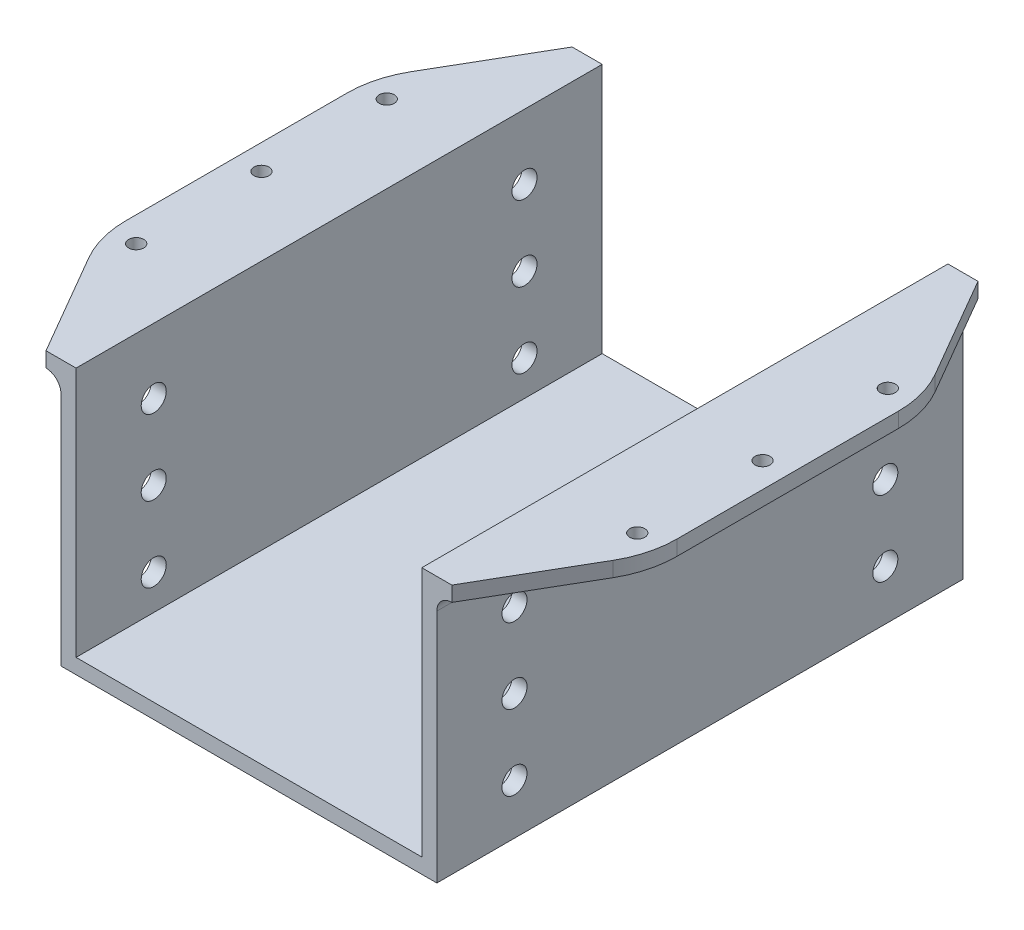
ISO-10303-21;
HEADER;
FILE_DESCRIPTION(('STEP AP214'),'2;1');
FILE_NAME('part.step','',(''),(''),'','','');
FILE_SCHEMA(('AUTOMOTIVE_DESIGN { 1 0 10303 214 1 1 1 1 }'));
ENDSEC;
DATA;
#1=APPLICATION_CONTEXT('core data for automotive mechanical design processes');
#2=APPLICATION_PROTOCOL_DEFINITION('international standard','automotive_design',2000,#1);
#3=PRODUCT_CONTEXT('',#1,'mechanical');
#4=PRODUCT('Part','Part','',(#3));
#5=PRODUCT_RELATED_PRODUCT_CATEGORY('part','',(#4));
#6=PRODUCT_DEFINITION_FORMATION('','',#4);
#7=PRODUCT_DEFINITION_CONTEXT('part definition',#1,'design');
#8=PRODUCT_DEFINITION('design','',#6,#7);
#9=PRODUCT_DEFINITION_SHAPE('','',#8);
#10=(LENGTH_UNIT() NAMED_UNIT(*) SI_UNIT(.MILLI.,.METRE.));
#11=(NAMED_UNIT(*) PLANE_ANGLE_UNIT() SI_UNIT($,.RADIAN.));
#12=(NAMED_UNIT(*) SI_UNIT($,.STERADIAN.) SOLID_ANGLE_UNIT());
#13=UNCERTAINTY_MEASURE_WITH_UNIT(LENGTH_MEASURE(1.E-05),#10,'distance_accuracy_value','');
#14=(GEOMETRIC_REPRESENTATION_CONTEXT(3) GLOBAL_UNCERTAINTY_ASSIGNED_CONTEXT((#13)) GLOBAL_UNIT_ASSIGNED_CONTEXT((#10,
#11,#12)) REPRESENTATION_CONTEXT('',''));
#15=CARTESIAN_POINT('',(0.,0.,0.));
#16=DIRECTION('',(0.,0.,1.));
#17=DIRECTION('',(1.,0.,0.));
#18=AXIS2_PLACEMENT_3D('',#15,#16,#17);
#19=CARTESIAN_POINT('',(35.5,26.5,105.));
#20=DIRECTION('',(0.,-1.,0.));
#21=DIRECTION('',(0.,0.,-1.));
#22=AXIS2_PLACEMENT_3D('',#19,#20,#21);
#23=PLANE('',#22);
#24=CARTESIAN_POINT('',(50.,26.5,77.5));
#25=DIRECTION('',(0.,1.,0.));
#26=DIRECTION('',(0.,0.,-1.));
#27=AXIS2_PLACEMENT_3D('',#24,#25,#26);
#28=CIRCLE('',#27,1.5);
#29=CARTESIAN_POINT('',(50.,26.5,76.));
#30=VERTEX_POINT('',#29);
#31=EDGE_CURVE('E326',#30,#30,#28,.T.);
#32=ORIENTED_EDGE('',*,*,#31,.F.);
#33=EDGE_LOOP('',(#32));
#34=FACE_BOUND('',#33,.T.);
#35=CARTESIAN_POINT('',(50.,26.5,52.5));
#36=DIRECTION('',(0.,1.,0.));
#37=DIRECTION('',(0.,0.,-1.));
#38=AXIS2_PLACEMENT_3D('',#35,#36,#37);
#39=CIRCLE('',#38,1.5);
#40=CARTESIAN_POINT('',(50.,26.5,51.));
#41=VERTEX_POINT('',#40);
#42=EDGE_CURVE('E334',#41,#41,#39,.T.);
#43=ORIENTED_EDGE('',*,*,#42,.F.);
#44=EDGE_LOOP('',(#43));
#45=FACE_BOUND('',#44,.T.);
#46=CARTESIAN_POINT('',(50.,26.5,27.5));
#47=DIRECTION('',(0.,1.,0.));
#48=DIRECTION('',(0.,0.,-1.));
#49=AXIS2_PLACEMENT_3D('',#46,#47,#48);
#50=CIRCLE('',#49,1.5);
#51=CARTESIAN_POINT('',(50.,26.5,26.));
#52=VERTEX_POINT('',#51);
#53=EDGE_CURVE('E289',#52,#52,#50,.T.);
#54=ORIENTED_EDGE('',*,*,#53,.F.);
#55=EDGE_LOOP('',(#54));
#56=FACE_BOUND('',#55,.T.);
#57=DIRECTION('',(0.,0.,-1.));
#58=VECTOR('',#57,1.);
#59=CARTESIAN_POINT('',(34.5,26.5,105.));
#60=LINE('',#59,#58);
#61=CARTESIAN_POINT('',(34.5,26.5,105.));
#62=VERTEX_POINT('',#61);
#63=CARTESIAN_POINT('',(34.5,26.5,0.));
#64=VERTEX_POINT('',#63);
#65=EDGE_CURVE('E211',#62,#64,#60,.T.);
#66=ORIENTED_EDGE('',*,*,#65,.F.);
#67=DIRECTION('',(-1.,0.,0.));
#68=VECTOR('',#67,1.);
#69=CARTESIAN_POINT('',(35.5,26.5,105.));
#70=LINE('',#69,#68);
#71=CARTESIAN_POINT('',(40.5,26.5,105.));
#72=VERTEX_POINT('',#71);
#73=EDGE_CURVE('E357',#72,#62,#70,.T.);
#74=ORIENTED_EDGE('',*,*,#73,.F.);
#75=DIRECTION('',(-0.501718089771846,0.,0.865031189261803));
#76=VECTOR('',#75,1.);
#77=CARTESIAN_POINT('',(55.,26.5,80.));
#78=LINE('',#77,#76);
#79=CARTESIAN_POINT('',(52.3006237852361,26.5,84.6540969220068));
#80=VERTEX_POINT('',#79);
#81=EDGE_CURVE('E273',#80,#72,#78,.T.);
#82=ORIENTED_EDGE('',*,*,#81,.F.);
#83=CARTESIAN_POINT('',(35.,26.5,74.6197351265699));
#84=DIRECTION('',(0.,-1.,0.));
#85=DIRECTION('',(0.,0.,-1.));
#86=AXIS2_PLACEMENT_3D('',#83,#84,#85);
#87=CIRCLE('',#86,20.);
#88=CARTESIAN_POINT('',(55.,26.5,74.6197351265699));
#89=VERTEX_POINT('',#88);
#90=EDGE_CURVE('E417',#80,#89,#87,.F.);
#91=ORIENTED_EDGE('',*,*,#90,.T.);
#92=DIRECTION('',(0.,0.,-1.));
#93=VECTOR('',#92,1.);
#94=CARTESIAN_POINT('',(55.,26.5,105.));
#95=LINE('',#94,#93);
#96=CARTESIAN_POINT('',(55.,26.5,30.3802648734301));
#97=VERTEX_POINT('',#96);
#98=EDGE_CURVE('E360',#89,#97,#95,.T.);
#99=ORIENTED_EDGE('',*,*,#98,.T.);
#100=CARTESIAN_POINT('',(35.,26.5,30.3802648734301));
#101=DIRECTION('',(0.,-1.,0.));
#102=DIRECTION('',(0.,0.,-1.));
#103=AXIS2_PLACEMENT_3D('',#100,#101,#102);
#104=CIRCLE('',#103,20.);
#105=CARTESIAN_POINT('',(52.300623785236,26.5,20.3459030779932));
#106=VERTEX_POINT('',#105);
#107=EDGE_CURVE('E420',#97,#106,#104,.F.);
#108=ORIENTED_EDGE('',*,*,#107,.T.);
#109=DIRECTION('',(0.501718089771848,0.,0.865031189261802));
#110=VECTOR('',#109,1.);
#111=CARTESIAN_POINT('',(55.,26.5,25.));
#112=LINE('',#111,#110);
#113=CARTESIAN_POINT('',(40.4999999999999,26.5,0.));
#114=VERTEX_POINT('',#113);
#115=EDGE_CURVE('E272',#114,#106,#112,.T.);
#116=ORIENTED_EDGE('',*,*,#115,.F.);
#117=DIRECTION('',(-1.,0.,0.));
#118=VECTOR('',#117,1.);
#119=CARTESIAN_POINT('',(35.5,26.5,0.));
#120=LINE('',#119,#118);
#121=EDGE_CURVE('E350',#114,#64,#120,.T.);
#122=ORIENTED_EDGE('',*,*,#121,.T.);
#123=EDGE_LOOP('',(#66,#74,#82,#91,#99,#108,#116,#122));
#124=FACE_BOUND('',#123,.T.);
#125=ADVANCED_FACE('F45',(#34,#45,#56,#124),#23,.F.);
#126=CARTESIAN_POINT('',(-55.,26.5,105.));
#127=DIRECTION('',(0.,-1.,0.));
#128=DIRECTION('',(0.,0.,-1.));
#129=AXIS2_PLACEMENT_3D('',#126,#127,#128);
#130=PLANE('',#129);
#131=CARTESIAN_POINT('',(-50.,26.5,52.5));
#132=DIRECTION('',(0.,1.,0.));
#133=DIRECTION('',(0.,0.,1.));
#134=AXIS2_PLACEMENT_3D('',#131,#132,#133);
#135=CIRCLE('',#134,1.5);
#136=CARTESIAN_POINT('',(-50.,26.5,54.));
#137=VERTEX_POINT('',#136);
#138=EDGE_CURVE('E313',#137,#137,#135,.T.);
#139=ORIENTED_EDGE('',*,*,#138,.F.);
#140=EDGE_LOOP('',(#139));
#141=FACE_BOUND('',#140,.T.);
#142=CARTESIAN_POINT('',(-50.,26.5,27.5));
#143=DIRECTION('',(0.,1.,0.));
#144=DIRECTION('',(0.,0.,1.));
#145=AXIS2_PLACEMENT_3D('',#142,#143,#144);
#146=CIRCLE('',#145,1.5);
#147=CARTESIAN_POINT('',(-50.,26.5,29.));
#148=VERTEX_POINT('',#147);
#149=EDGE_CURVE('E309',#148,#148,#146,.T.);
#150=ORIENTED_EDGE('',*,*,#149,.F.);
#151=EDGE_LOOP('',(#150));
#152=FACE_BOUND('',#151,.T.);
#153=CARTESIAN_POINT('',(-50.,26.5,77.5));
#154=DIRECTION('',(0.,1.,0.));
#155=DIRECTION('',(0.,0.,1.));
#156=AXIS2_PLACEMENT_3D('',#153,#154,#155);
#157=CIRCLE('',#156,1.5);
#158=CARTESIAN_POINT('',(-50.,26.5,79.));
#159=VERTEX_POINT('',#158);
#160=EDGE_CURVE('E318',#159,#159,#157,.T.);
#161=ORIENTED_EDGE('',*,*,#160,.F.);
#162=EDGE_LOOP('',(#161));
#163=FACE_BOUND('',#162,.T.);
#164=DIRECTION('',(0.,0.,1.));
#165=VECTOR('',#164,1.);
#166=CARTESIAN_POINT('',(-34.5,26.5,0.));
#167=LINE('',#166,#165);
#168=CARTESIAN_POINT('',(-34.5,26.5,0.));
#169=VERTEX_POINT('',#168);
#170=CARTESIAN_POINT('',(-34.5,26.5,105.));
#171=VERTEX_POINT('',#170);
#172=EDGE_CURVE('E236',#169,#171,#167,.T.);
#173=ORIENTED_EDGE('',*,*,#172,.F.);
#174=DIRECTION('',(-1.,0.,0.));
#175=VECTOR('',#174,1.);
#176=CARTESIAN_POINT('',(-55.,26.5,0.));
#177=LINE('',#176,#175);
#178=CARTESIAN_POINT('',(-40.5,26.5,0.));
#179=VERTEX_POINT('',#178);
#180=EDGE_CURVE('E197',#169,#179,#177,.T.);
#181=ORIENTED_EDGE('',*,*,#180,.T.);
#182=DIRECTION('',(0.501718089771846,0.,-0.865031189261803));
#183=VECTOR('',#182,1.);
#184=CARTESIAN_POINT('',(-55.,26.5,25.));
#185=LINE('',#184,#183);
#186=CARTESIAN_POINT('',(-52.3006237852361,26.5,20.3459030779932));
#187=VERTEX_POINT('',#186);
#188=EDGE_CURVE('E259',#187,#179,#185,.T.);
#189=ORIENTED_EDGE('',*,*,#188,.F.);
#190=CARTESIAN_POINT('',(-35.,26.5,30.3802648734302));
#191=DIRECTION('',(0.,-1.,0.));
#192=DIRECTION('',(0.,0.,-1.));
#193=AXIS2_PLACEMENT_3D('',#190,#191,#192);
#194=CIRCLE('',#193,20.);
#195=CARTESIAN_POINT('',(-55.,26.5,30.3802648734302));
#196=VERTEX_POINT('',#195);
#197=EDGE_CURVE('E391',#187,#196,#194,.F.);
#198=ORIENTED_EDGE('',*,*,#197,.T.);
#199=DIRECTION('',(0.,0.,-1.));
#200=VECTOR('',#199,1.);
#201=CARTESIAN_POINT('',(-55.,26.5,105.));
#202=LINE('',#201,#200);
#203=CARTESIAN_POINT('',(-55.,26.5,74.6197351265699));
#204=VERTEX_POINT('',#203);
#205=EDGE_CURVE('E380',#204,#196,#202,.T.);
#206=ORIENTED_EDGE('',*,*,#205,.F.);
#207=CARTESIAN_POINT('',(-35.,26.5,74.6197351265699));
#208=DIRECTION('',(0.,-1.,0.));
#209=DIRECTION('',(0.,0.,-1.));
#210=AXIS2_PLACEMENT_3D('',#207,#208,#209);
#211=CIRCLE('',#210,20.);
#212=CARTESIAN_POINT('',(-52.3006237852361,26.5,84.6540969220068));
#213=VERTEX_POINT('',#212);
#214=EDGE_CURVE('E394',#204,#213,#211,.F.);
#215=ORIENTED_EDGE('',*,*,#214,.T.);
#216=DIRECTION('',(-0.501718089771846,0.,-0.865031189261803));
#217=VECTOR('',#216,1.);
#218=CARTESIAN_POINT('',(-55.,26.5,80.));
#219=LINE('',#218,#217);
#220=CARTESIAN_POINT('',(-40.5,26.5,105.));
#221=VERTEX_POINT('',#220);
#222=EDGE_CURVE('E298',#221,#213,#219,.T.);
#223=ORIENTED_EDGE('',*,*,#222,.F.);
#224=DIRECTION('',(-1.,0.,0.));
#225=VECTOR('',#224,1.);
#226=CARTESIAN_POINT('',(-55.,26.5,105.));
#227=LINE('',#226,#225);
#228=EDGE_CURVE('E349',#171,#221,#227,.T.);
#229=ORIENTED_EDGE('',*,*,#228,.F.);
#230=EDGE_LOOP('',(#173,#181,#189,#198,#206,#215,#223,#229));
#231=FACE_BOUND('',#230,.T.);
#232=ADVANCED_FACE('F510',(#141,#152,#163,#231),#130,.F.);
#233=CARTESIAN_POINT('',(-32.5,-23.5,105.));
#234=DIRECTION('',(0.,-1.,0.));
#235=DIRECTION('',(0.,0.,-1.));
#236=AXIS2_PLACEMENT_3D('',#233,#234,#235);
#237=PLANE('',#236);
#238=DIRECTION('',(-1.,0.,0.));
#239=VECTOR('',#238,1.);
#240=CARTESIAN_POINT('',(-32.5,-23.5,0.));
#241=LINE('',#240,#239);
#242=CARTESIAN_POINT('',(34.5,-23.5,0.));
#243=VERTEX_POINT('',#242);
#244=CARTESIAN_POINT('',(-34.5,-23.5,0.));
#245=VERTEX_POINT('',#244);
#246=EDGE_CURVE('E184',#243,#245,#241,.T.);
#247=ORIENTED_EDGE('',*,*,#246,.T.);
#248=DIRECTION('',(0.,0.,-1.));
#249=VECTOR('',#248,1.);
#250=CARTESIAN_POINT('',(-34.5,-23.5,105.));
#251=LINE('',#250,#249);
#252=CARTESIAN_POINT('',(-34.5,-23.5,105.));
#253=VERTEX_POINT('',#252);
#254=EDGE_CURVE('E231',#253,#245,#251,.T.);
#255=ORIENTED_EDGE('',*,*,#254,.F.);
#256=DIRECTION('',(-1.,0.,0.));
#257=VECTOR('',#256,1.);
#258=CARTESIAN_POINT('',(-32.5,-23.5,105.));
#259=LINE('',#258,#257);
#260=CARTESIAN_POINT('',(34.5,-23.5,105.));
#261=VERTEX_POINT('',#260);
#262=EDGE_CURVE('E203',#261,#253,#259,.T.);
#263=ORIENTED_EDGE('',*,*,#262,.F.);
#264=DIRECTION('',(0.,0.,1.));
#265=VECTOR('',#264,1.);
#266=CARTESIAN_POINT('',(34.5,-23.5,0.));
#267=LINE('',#266,#265);
#268=EDGE_CURVE('E201',#243,#261,#267,.T.);
#269=ORIENTED_EDGE('',*,*,#268,.F.);
#270=EDGE_LOOP('',(#247,#255,#263,#269));
#271=FACE_BOUND('',#270,.T.);
#272=ADVANCED_FACE('F202',(#271),#237,.F.);
#273=CARTESIAN_POINT('',(-55.,23.5,105.));
#274=DIRECTION('',(1.,0.,0.));
#275=DIRECTION('',(0.,0.,-1.));
#276=AXIS2_PLACEMENT_3D('',#273,#274,#275);
#277=PLANE('',#276);
#278=DIRECTION('',(0.,0.,-1.));
#279=VECTOR('',#278,1.);
#280=CARTESIAN_POINT('',(-55.,23.5,105.));
#281=LINE('',#280,#279);
#282=CARTESIAN_POINT('',(-55.,23.5,74.6197351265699));
#283=VERTEX_POINT('',#282);
#284=CARTESIAN_POINT('',(-55.,23.5,30.3802648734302));
#285=VERTEX_POINT('',#284);
#286=EDGE_CURVE('E376',#283,#285,#281,.T.);
#287=ORIENTED_EDGE('',*,*,#286,.F.);
#288=DIRECTION('',(0.,1.,0.));
#289=VECTOR('',#288,1.);
#290=CARTESIAN_POINT('',(-55.,23.5,74.6197351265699));
#291=LINE('',#290,#289);
#292=EDGE_CURVE('E387',#283,#204,#291,.T.);
#293=ORIENTED_EDGE('',*,*,#292,.T.);
#294=ORIENTED_EDGE('',*,*,#205,.T.);
#295=DIRECTION('',(0.,1.,0.));
#296=VECTOR('',#295,1.);
#297=CARTESIAN_POINT('',(-55.,23.5,30.3802648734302));
#298=LINE('',#297,#296);
#299=EDGE_CURVE('E384',#196,#285,#298,.F.);
#300=ORIENTED_EDGE('',*,*,#299,.T.);
#301=EDGE_LOOP('',(#287,#293,#294,#300));
#302=FACE_BOUND('',#301,.T.);
#303=ADVANCED_FACE('F525',(#302),#277,.F.);
#304=CARTESIAN_POINT('',(-35.5,23.5,105.));
#305=DIRECTION('',(0.,1.,0.));
#306=DIRECTION('',(0.,0.,1.));
#307=AXIS2_PLACEMENT_3D('',#304,#305,#306);
#308=PLANE('',#307);
#309=CARTESIAN_POINT('',(-50.,23.5,77.5));
#310=DIRECTION('',(0.,1.,0.));
#311=DIRECTION('',(0.,0.,1.));
#312=AXIS2_PLACEMENT_3D('',#309,#310,#311);
#313=CIRCLE('',#312,1.5);
#314=CARTESIAN_POINT('',(-50.,23.5,79.));
#315=VERTEX_POINT('',#314);
#316=EDGE_CURVE('E322',#315,#315,#313,.T.);
#317=ORIENTED_EDGE('',*,*,#316,.T.);
#318=EDGE_LOOP('',(#317));
#319=FACE_BOUND('',#318,.T.);
#320=CARTESIAN_POINT('',(-50.,23.5,27.5));
#321=DIRECTION('',(0.,1.,0.));
#322=DIRECTION('',(0.,0.,1.));
#323=AXIS2_PLACEMENT_3D('',#320,#321,#322);
#324=CIRCLE('',#323,1.5);
#325=CARTESIAN_POINT('',(-50.,23.5,29.));
#326=VERTEX_POINT('',#325);
#327=EDGE_CURVE('E314',#326,#326,#324,.T.);
#328=ORIENTED_EDGE('',*,*,#327,.T.);
#329=EDGE_LOOP('',(#328));
#330=FACE_BOUND('',#329,.T.);
#331=CARTESIAN_POINT('',(-50.,23.5,52.5));
#332=DIRECTION('',(0.,1.,0.));
#333=DIRECTION('',(0.,0.,1.));
#334=AXIS2_PLACEMENT_3D('',#331,#332,#333);
#335=CIRCLE('',#334,1.5);
#336=CARTESIAN_POINT('',(-50.,23.5,54.));
#337=VERTEX_POINT('',#336);
#338=EDGE_CURVE('E198',#337,#337,#335,.T.);
#339=ORIENTED_EDGE('',*,*,#338,.T.);
#340=EDGE_LOOP('',(#339));
#341=FACE_BOUND('',#340,.T.);
#342=DIRECTION('',(0.501718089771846,0.,-0.865031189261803));
#343=VECTOR('',#342,1.);
#344=CARTESIAN_POINT('',(-55.,23.5,25.));
#345=LINE('',#344,#343);
#346=CARTESIAN_POINT('',(-52.3006237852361,23.5,20.3459030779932));
#347=VERTEX_POINT('',#346);
#348=CARTESIAN_POINT('',(-40.5,23.5,0.));
#349=VERTEX_POINT('',#348);
#350=EDGE_CURVE('E258',#347,#349,#345,.T.);
#351=ORIENTED_EDGE('',*,*,#350,.T.);
#352=DIRECTION('',(0.,0.,-1.));
#353=VECTOR('',#352,1.);
#354=CARTESIAN_POINT('',(-40.5,23.5,105.));
#355=LINE('',#354,#353);
#356=CARTESIAN_POINT('',(-40.5,23.5,105.));
#357=VERTEX_POINT('',#356);
#358=EDGE_CURVE('E440',#349,#357,#355,.F.);
#359=ORIENTED_EDGE('',*,*,#358,.T.);
#360=DIRECTION('',(-0.501718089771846,0.,-0.865031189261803));
#361=VECTOR('',#360,1.);
#362=CARTESIAN_POINT('',(-55.,23.5,80.));
#363=LINE('',#362,#361);
#364=CARTESIAN_POINT('',(-52.3006237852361,23.5,84.6540969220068));
#365=VERTEX_POINT('',#364);
#366=EDGE_CURVE('E302',#357,#365,#363,.T.);
#367=ORIENTED_EDGE('',*,*,#366,.T.);
#368=CARTESIAN_POINT('',(-35.,23.5,74.6197351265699));
#369=DIRECTION('',(0.,1.,0.));
#370=DIRECTION('',(0.,0.,1.));
#371=AXIS2_PLACEMENT_3D('',#368,#369,#370);
#372=CIRCLE('',#371,20.);
#373=EDGE_CURVE('E403',#365,#283,#372,.F.);
#374=ORIENTED_EDGE('',*,*,#373,.T.);
#375=ORIENTED_EDGE('',*,*,#286,.T.);
#376=CARTESIAN_POINT('',(-35.,23.5,30.3802648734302));
#377=DIRECTION('',(0.,1.,0.));
#378=DIRECTION('',(0.,0.,1.));
#379=AXIS2_PLACEMENT_3D('',#376,#377,#378);
#380=CIRCLE('',#379,20.);
#381=EDGE_CURVE('E400',#285,#347,#380,.F.);
#382=ORIENTED_EDGE('',*,*,#381,.T.);
#383=EDGE_LOOP('',(#351,#359,#367,#374,#375,#382));
#384=FACE_BOUND('',#383,.T.);
#385=ADVANCED_FACE('F522',(#319,#330,#341,#384),#308,.F.);
#386=CARTESIAN_POINT('',(-35.5,-26.5,105.));
#387=DIRECTION('',(0.,1.,0.));
#388=DIRECTION('',(0.,0.,1.));
#389=AXIS2_PLACEMENT_3D('',#386,#387,#388);
#390=PLANE('',#389);
#391=DIRECTION('',(1.,0.,0.));
#392=VECTOR('',#391,1.);
#393=CARTESIAN_POINT('',(-35.5,-26.5,0.));
#394=LINE('',#393,#392);
#395=CARTESIAN_POINT('',(-37.5,-26.5,0.));
#396=VERTEX_POINT('',#395);
#397=CARTESIAN_POINT('',(37.5,-26.5,0.));
#398=VERTEX_POINT('',#397);
#399=EDGE_CURVE('E364',#396,#398,#394,.T.);
#400=ORIENTED_EDGE('',*,*,#399,.T.);
#401=DIRECTION('',(0.,0.,-1.));
#402=VECTOR('',#401,1.);
#403=CARTESIAN_POINT('',(37.5,-26.5,105.));
#404=LINE('',#403,#402);
#405=CARTESIAN_POINT('',(37.5,-26.5,105.));
#406=VERTEX_POINT('',#405);
#407=EDGE_CURVE('E221',#406,#398,#404,.T.);
#408=ORIENTED_EDGE('',*,*,#407,.F.);
#409=DIRECTION('',(1.,0.,0.));
#410=VECTOR('',#409,1.);
#411=CARTESIAN_POINT('',(-35.5,-26.5,105.));
#412=LINE('',#411,#410);
#413=CARTESIAN_POINT('',(-37.5,-26.5,105.));
#414=VERTEX_POINT('',#413);
#415=EDGE_CURVE('E353',#414,#406,#412,.T.);
#416=ORIENTED_EDGE('',*,*,#415,.F.);
#417=DIRECTION('',(0.,0.,1.));
#418=VECTOR('',#417,1.);
#419=CARTESIAN_POINT('',(-37.5,-26.5,0.));
#420=LINE('',#419,#418);
#421=EDGE_CURVE('E246',#396,#414,#420,.T.);
#422=ORIENTED_EDGE('',*,*,#421,.F.);
#423=EDGE_LOOP('',(#400,#408,#416,#422));
#424=FACE_BOUND('',#423,.T.);
#425=ADVANCED_FACE('F546',(#424),#390,.F.);
#426=CARTESIAN_POINT('',(35.5,23.5,105.));
#427=DIRECTION('',(0.,1.,0.));
#428=DIRECTION('',(0.,0.,1.));
#429=AXIS2_PLACEMENT_3D('',#426,#427,#428);
#430=PLANE('',#429);
#431=CARTESIAN_POINT('',(50.,23.5,27.5));
#432=DIRECTION('',(0.,1.,0.));
#433=DIRECTION('',(0.,0.,-1.));
#434=AXIS2_PLACEMENT_3D('',#431,#432,#433);
#435=CIRCLE('',#434,1.5);
#436=CARTESIAN_POINT('',(50.,23.5,26.));
#437=VERTEX_POINT('',#436);
#438=EDGE_CURVE('E294',#437,#437,#435,.T.);
#439=ORIENTED_EDGE('',*,*,#438,.T.);
#440=EDGE_LOOP('',(#439));
#441=FACE_BOUND('',#440,.T.);
#442=CARTESIAN_POINT('',(50.,23.5,52.5));
#443=DIRECTION('',(0.,1.,0.));
#444=DIRECTION('',(0.,0.,-1.));
#445=AXIS2_PLACEMENT_3D('',#442,#443,#444);
#446=CIRCLE('',#445,1.5);
#447=CARTESIAN_POINT('',(50.,23.5,51.));
#448=VERTEX_POINT('',#447);
#449=EDGE_CURVE('E293',#448,#448,#446,.T.);
#450=ORIENTED_EDGE('',*,*,#449,.T.);
#451=EDGE_LOOP('',(#450));
#452=FACE_BOUND('',#451,.T.);
#453=CARTESIAN_POINT('',(50.,23.5,77.5));
#454=DIRECTION('',(0.,1.,0.));
#455=DIRECTION('',(0.,0.,-1.));
#456=AXIS2_PLACEMENT_3D('',#453,#454,#455);
#457=CIRCLE('',#456,1.5);
#458=CARTESIAN_POINT('',(50.,23.5,76.));
#459=VERTEX_POINT('',#458);
#460=EDGE_CURVE('E330',#459,#459,#457,.T.);
#461=ORIENTED_EDGE('',*,*,#460,.T.);
#462=EDGE_LOOP('',(#461));
#463=FACE_BOUND('',#462,.T.);
#464=DIRECTION('',(-0.501718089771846,0.,0.865031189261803));
#465=VECTOR('',#464,1.);
#466=CARTESIAN_POINT('',(55.,23.5,80.));
#467=LINE('',#466,#465);
#468=CARTESIAN_POINT('',(52.3006237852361,23.5,84.6540969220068));
#469=VERTEX_POINT('',#468);
#470=CARTESIAN_POINT('',(40.5,23.5,105.));
#471=VERTEX_POINT('',#470);
#472=EDGE_CURVE('E271',#469,#471,#467,.T.);
#473=ORIENTED_EDGE('',*,*,#472,.T.);
#474=DIRECTION('',(0.,0.,1.));
#475=VECTOR('',#474,1.);
#476=CARTESIAN_POINT('',(40.5,23.5,105.));
#477=LINE('',#476,#475);
#478=CARTESIAN_POINT('',(40.4999999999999,23.5,0.));
#479=VERTEX_POINT('',#478);
#480=EDGE_CURVE('E446',#471,#479,#477,.F.);
#481=ORIENTED_EDGE('',*,*,#480,.T.);
#482=DIRECTION('',(0.501718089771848,0.,0.865031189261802));
#483=VECTOR('',#482,1.);
#484=CARTESIAN_POINT('',(55.,23.5,25.));
#485=LINE('',#484,#483);
#486=CARTESIAN_POINT('',(52.300623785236,23.5,20.3459030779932));
#487=VERTEX_POINT('',#486);
#488=EDGE_CURVE('E282',#479,#487,#485,.T.);
#489=ORIENTED_EDGE('',*,*,#488,.T.);
#490=CARTESIAN_POINT('',(35.,23.5,30.3802648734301));
#491=DIRECTION('',(0.,1.,0.));
#492=DIRECTION('',(0.,0.,1.));
#493=AXIS2_PLACEMENT_3D('',#490,#491,#492);
#494=CIRCLE('',#493,20.);
#495=CARTESIAN_POINT('',(55.,23.5,30.3802648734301));
#496=VERTEX_POINT('',#495);
#497=EDGE_CURVE('E429',#487,#496,#494,.F.);
#498=ORIENTED_EDGE('',*,*,#497,.T.);
#499=DIRECTION('',(0.,0.,-1.));
#500=VECTOR('',#499,1.);
#501=CARTESIAN_POINT('',(55.,23.5,105.));
#502=LINE('',#501,#500);
#503=CARTESIAN_POINT('',(55.,23.5,74.6197351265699));
#504=VERTEX_POINT('',#503);
#505=EDGE_CURVE('E372',#504,#496,#502,.T.);
#506=ORIENTED_EDGE('',*,*,#505,.F.);
#507=CARTESIAN_POINT('',(35.,23.5,74.6197351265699));
#508=DIRECTION('',(0.,1.,0.));
#509=DIRECTION('',(0.,0.,1.));
#510=AXIS2_PLACEMENT_3D('',#507,#508,#509);
#511=CIRCLE('',#510,20.);
#512=EDGE_CURVE('E426',#504,#469,#511,.F.);
#513=ORIENTED_EDGE('',*,*,#512,.T.);
#514=EDGE_LOOP('',(#473,#481,#489,#498,#506,#513));
#515=FACE_BOUND('',#514,.T.);
#516=ADVANCED_FACE('F552',(#441,#452,#463,#515),#430,.F.);
#517=CARTESIAN_POINT('',(55.,23.5,105.));
#518=DIRECTION('',(-1.,0.,0.));
#519=DIRECTION('',(0.,0.,1.));
#520=AXIS2_PLACEMENT_3D('',#517,#518,#519);
#521=PLANE('',#520);
#522=ORIENTED_EDGE('',*,*,#505,.T.);
#523=DIRECTION('',(0.,1.,0.));
#524=VECTOR('',#523,1.);
#525=CARTESIAN_POINT('',(55.,23.5,30.3802648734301));
#526=LINE('',#525,#524);
#527=EDGE_CURVE('E413',#496,#97,#526,.T.);
#528=ORIENTED_EDGE('',*,*,#527,.T.);
#529=ORIENTED_EDGE('',*,*,#98,.F.);
#530=DIRECTION('',(0.,1.,0.));
#531=VECTOR('',#530,1.);
#532=CARTESIAN_POINT('',(55.,23.5,74.6197351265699));
#533=LINE('',#532,#531);
#534=EDGE_CURVE('E410',#89,#504,#533,.F.);
#535=ORIENTED_EDGE('',*,*,#534,.T.);
#536=EDGE_LOOP('',(#522,#528,#529,#535));
#537=FACE_BOUND('',#536,.T.);
#538=ADVANCED_FACE('F568',(#537),#521,.F.);
#539=CARTESIAN_POINT('',(0.,0.,105.));
#540=DIRECTION('',(0.,0.,1.));
#541=DIRECTION('',(1.,0.,0.));
#542=AXIS2_PLACEMENT_3D('',#539,#540,#541);
#543=PLANE('',#542);
#544=DIRECTION('',(0.,1.,0.));
#545=VECTOR('',#544,1.);
#546=CARTESIAN_POINT('',(34.5,-23.5,105.));
#547=LINE('',#546,#545);
#548=EDGE_CURVE('E207',#261,#62,#547,.T.);
#549=ORIENTED_EDGE('',*,*,#548,.F.);
#550=ORIENTED_EDGE('',*,*,#262,.T.);
#551=DIRECTION('',(0.,-1.,0.));
#552=VECTOR('',#551,1.);
#553=CARTESIAN_POINT('',(-34.5,26.5,105.));
#554=LINE('',#553,#552);
#555=EDGE_CURVE('E239',#171,#253,#554,.T.);
#556=ORIENTED_EDGE('',*,*,#555,.F.);
#557=ORIENTED_EDGE('',*,*,#228,.T.);
#558=DIRECTION('',(0.,1.,0.));
#559=VECTOR('',#558,1.);
#560=CARTESIAN_POINT('',(-40.5,23.5,105.));
#561=LINE('',#560,#559);
#562=EDGE_CURVE('E276',#357,#221,#561,.T.);
#563=ORIENTED_EDGE('',*,*,#562,.F.);
#564=CARTESIAN_POINT('',(-40.5,20.5,105.));
#565=DIRECTION('',(0.,0.,1.));
#566=DIRECTION('',(1.,0.,0.));
#567=AXIS2_PLACEMENT_3D('',#564,#565,#566);
#568=CIRCLE('',#567,3.);
#569=CARTESIAN_POINT('',(-37.5,20.5,105.));
#570=VERTEX_POINT('',#569);
#571=EDGE_CURVE('E452',#357,#570,#568,.F.);
#572=ORIENTED_EDGE('',*,*,#571,.T.);
#573=DIRECTION('',(0.,1.,0.));
#574=VECTOR('',#573,1.);
#575=CARTESIAN_POINT('',(-37.5,-26.5,105.));
#576=LINE('',#575,#574);
#577=EDGE_CURVE('E250',#414,#570,#576,.T.);
#578=ORIENTED_EDGE('',*,*,#577,.F.);
#579=ORIENTED_EDGE('',*,*,#415,.T.);
#580=DIRECTION('',(0.,-1.,0.));
#581=VECTOR('',#580,1.);
#582=CARTESIAN_POINT('',(37.5,23.5,105.));
#583=LINE('',#582,#581);
#584=CARTESIAN_POINT('',(37.5,20.5,105.));
#585=VERTEX_POINT('',#584);
#586=EDGE_CURVE('E228',#585,#406,#583,.T.);
#587=ORIENTED_EDGE('',*,*,#586,.F.);
#588=CARTESIAN_POINT('',(40.5,20.5,105.));
#589=DIRECTION('',(0.,0.,1.));
#590=DIRECTION('',(1.,0.,0.));
#591=AXIS2_PLACEMENT_3D('',#588,#589,#590);
#592=CIRCLE('',#591,3.);
#593=EDGE_CURVE('E55',#585,#471,#592,.F.);
#594=ORIENTED_EDGE('',*,*,#593,.T.);
#595=DIRECTION('',(0.,1.,0.));
#596=VECTOR('',#595,1.);
#597=CARTESIAN_POINT('',(40.5,23.5,105.));
#598=LINE('',#597,#596);
#599=EDGE_CURVE('E267',#471,#72,#598,.T.);
#600=ORIENTED_EDGE('',*,*,#599,.T.);
#601=ORIENTED_EDGE('',*,*,#73,.T.);
#602=EDGE_LOOP('',(#549,#550,#556,#557,#563,#572,#578,#579,#587,#594,#600,#601));
#603=FACE_BOUND('',#602,.T.);
#604=ADVANCED_FACE('F506',(#603),#543,.T.);
#605=CARTESIAN_POINT('',(0.,0.,0.));
#606=DIRECTION('',(0.,0.,1.));
#607=DIRECTION('',(1.,0.,0.));
#608=AXIS2_PLACEMENT_3D('',#605,#606,#607);
#609=PLANE('',#608);
#610=ORIENTED_EDGE('',*,*,#246,.F.);
#611=DIRECTION('',(0.,-1.,0.));
#612=VECTOR('',#611,1.);
#613=CARTESIAN_POINT('',(34.5,26.5,0.));
#614=LINE('',#613,#612);
#615=EDGE_CURVE('E189',#64,#243,#614,.T.);
#616=ORIENTED_EDGE('',*,*,#615,.F.);
#617=ORIENTED_EDGE('',*,*,#121,.F.);
#618=DIRECTION('',(0.,1.,0.));
#619=VECTOR('',#618,1.);
#620=CARTESIAN_POINT('',(40.4999999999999,23.5,0.));
#621=LINE('',#620,#619);
#622=EDGE_CURVE('E263',#479,#114,#621,.T.);
#623=ORIENTED_EDGE('',*,*,#622,.F.);
#624=CARTESIAN_POINT('',(40.5,20.5,0.));
#625=DIRECTION('',(0.,0.,1.));
#626=DIRECTION('',(1.,0.,0.));
#627=AXIS2_PLACEMENT_3D('',#624,#625,#626);
#628=CIRCLE('',#627,3.);
#629=CARTESIAN_POINT('',(37.5,20.5,0.));
#630=VERTEX_POINT('',#629);
#631=EDGE_CURVE('E11',#479,#630,#628,.T.);
#632=ORIENTED_EDGE('',*,*,#631,.T.);
#633=DIRECTION('',(0.,1.,0.));
#634=VECTOR('',#633,1.);
#635=CARTESIAN_POINT('',(37.5,-26.5,0.));
#636=LINE('',#635,#634);
#637=EDGE_CURVE('E225',#398,#630,#636,.T.);
#638=ORIENTED_EDGE('',*,*,#637,.F.);
#639=ORIENTED_EDGE('',*,*,#399,.F.);
#640=DIRECTION('',(0.,-1.,0.));
#641=VECTOR('',#640,1.);
#642=CARTESIAN_POINT('',(-37.5,23.5,0.));
#643=LINE('',#642,#641);
#644=CARTESIAN_POINT('',(-37.5,20.5,0.));
#645=VERTEX_POINT('',#644);
#646=EDGE_CURVE('E243',#645,#396,#643,.T.);
#647=ORIENTED_EDGE('',*,*,#646,.F.);
#648=CARTESIAN_POINT('',(-40.5,20.5,0.));
#649=DIRECTION('',(0.,0.,1.));
#650=DIRECTION('',(1.,0.,0.));
#651=AXIS2_PLACEMENT_3D('',#648,#649,#650);
#652=CIRCLE('',#651,3.);
#653=EDGE_CURVE('E449',#645,#349,#652,.T.);
#654=ORIENTED_EDGE('',*,*,#653,.T.);
#655=DIRECTION('',(0.,1.,0.));
#656=VECTOR('',#655,1.);
#657=CARTESIAN_POINT('',(-40.5,23.5,0.));
#658=LINE('',#657,#656);
#659=EDGE_CURVE('E254',#349,#179,#658,.T.);
#660=ORIENTED_EDGE('',*,*,#659,.T.);
#661=ORIENTED_EDGE('',*,*,#180,.F.);
#662=DIRECTION('',(0.,1.,0.));
#663=VECTOR('',#662,1.);
#664=CARTESIAN_POINT('',(-34.5,-23.5,0.));
#665=LINE('',#664,#663);
#666=EDGE_CURVE('E192',#245,#169,#665,.T.);
#667=ORIENTED_EDGE('',*,*,#666,.F.);
#668=EDGE_LOOP('',(#610,#616,#617,#623,#632,#638,#639,#647,#654,#660,#661,#667));
#669=FACE_BOUND('',#668,.T.);
#670=ADVANCED_FACE('F186',(#669),#609,.F.);
#671=CARTESIAN_POINT('',(-55.,23.5,25.));
#672=DIRECTION('',(0.865031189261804,0.,0.501718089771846));
#673=DIRECTION('',(0.501718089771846,0.,-0.865031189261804));
#674=AXIS2_PLACEMENT_3D('',#671,#672,#673);
#675=PLANE('',#674);
#676=ORIENTED_EDGE('',*,*,#350,.F.);
#677=DIRECTION('',(0.,1.,0.));
#678=VECTOR('',#677,1.);
#679=CARTESIAN_POINT('',(-52.3006237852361,23.5,20.3459030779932));
#680=LINE('',#679,#678);
#681=EDGE_CURVE('E406',#347,#187,#680,.T.);
#682=ORIENTED_EDGE('',*,*,#681,.T.);
#683=ORIENTED_EDGE('',*,*,#188,.T.);
#684=ORIENTED_EDGE('',*,*,#659,.F.);
#685=EDGE_LOOP('',(#676,#682,#683,#684));
#686=FACE_BOUND('',#685,.T.);
#687=ADVANCED_FACE('F533',(#686),#675,.F.);
#688=CARTESIAN_POINT('',(55.,23.5,25.));
#689=DIRECTION('',(-0.865031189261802,0.,0.501718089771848));
#690=DIRECTION('',(0.501718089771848,0.,0.865031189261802));
#691=AXIS2_PLACEMENT_3D('',#688,#689,#690);
#692=PLANE('',#691);
#693=ORIENTED_EDGE('',*,*,#115,.T.);
#694=DIRECTION('',(0.,1.,0.));
#695=VECTOR('',#694,1.);
#696=CARTESIAN_POINT('',(52.300623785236,23.5,20.3459030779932));
#697=LINE('',#696,#695);
#698=EDGE_CURVE('E423',#106,#487,#697,.F.);
#699=ORIENTED_EDGE('',*,*,#698,.T.);
#700=ORIENTED_EDGE('',*,*,#488,.F.);
#701=ORIENTED_EDGE('',*,*,#622,.T.);
#702=EDGE_LOOP('',(#693,#699,#700,#701));
#703=FACE_BOUND('',#702,.T.);
#704=ADVANCED_FACE('F557',(#703),#692,.F.);
#705=CARTESIAN_POINT('',(55.,23.5,80.));
#706=DIRECTION('',(-0.865031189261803,0.,-0.501718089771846));
#707=DIRECTION('',(-0.501718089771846,0.,0.865031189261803));
#708=AXIS2_PLACEMENT_3D('',#705,#706,#707);
#709=PLANE('',#708);
#710=ORIENTED_EDGE('',*,*,#472,.F.);
#711=DIRECTION('',(0.,1.,0.));
#712=VECTOR('',#711,1.);
#713=CARTESIAN_POINT('',(52.3006237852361,23.5,84.6540969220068));
#714=LINE('',#713,#712);
#715=EDGE_CURVE('E432',#469,#80,#714,.T.);
#716=ORIENTED_EDGE('',*,*,#715,.T.);
#717=ORIENTED_EDGE('',*,*,#81,.T.);
#718=ORIENTED_EDGE('',*,*,#599,.F.);
#719=EDGE_LOOP('',(#710,#716,#717,#718));
#720=FACE_BOUND('',#719,.T.);
#721=ADVANCED_FACE('F575',(#720),#709,.F.);
#722=CARTESIAN_POINT('',(-55.,23.5,80.));
#723=DIRECTION('',(0.865031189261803,0.,-0.501718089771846));
#724=DIRECTION('',(-0.501718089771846,0.,-0.865031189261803));
#725=AXIS2_PLACEMENT_3D('',#722,#723,#724);
#726=PLANE('',#725);
#727=ORIENTED_EDGE('',*,*,#222,.T.);
#728=DIRECTION('',(0.,1.,0.));
#729=VECTOR('',#728,1.);
#730=CARTESIAN_POINT('',(-52.3006237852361,23.5,84.6540969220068));
#731=LINE('',#730,#729);
#732=EDGE_CURVE('E397',#213,#365,#731,.F.);
#733=ORIENTED_EDGE('',*,*,#732,.T.);
#734=ORIENTED_EDGE('',*,*,#366,.F.);
#735=ORIENTED_EDGE('',*,*,#562,.T.);
#736=EDGE_LOOP('',(#727,#733,#734,#735));
#737=FACE_BOUND('',#736,.T.);
#738=ADVANCED_FACE('F514',(#737),#726,.F.);
#739=CARTESIAN_POINT('',(50.,23.5,77.5));
#740=DIRECTION('',(0.,1.,0.));
#741=DIRECTION('',(0.,0.,1.));
#742=AXIS2_PLACEMENT_3D('',#739,#740,#741);
#743=CYLINDRICAL_SURFACE('',#742,1.5);
#744=ORIENTED_EDGE('',*,*,#460,.F.);
#745=EDGE_LOOP('',(#744));
#746=FACE_BOUND('',#745,.T.);
#747=ORIENTED_EDGE('',*,*,#31,.T.);
#748=EDGE_LOOP('',(#747));
#749=FACE_BOUND('',#748,.T.);
#750=ADVANCED_FACE('F583',(#746,#749),#743,.F.);
#751=CARTESIAN_POINT('',(50.,23.5,52.5));
#752=DIRECTION('',(0.,1.,0.));
#753=DIRECTION('',(0.,0.,1.));
#754=AXIS2_PLACEMENT_3D('',#751,#752,#753);
#755=CYLINDRICAL_SURFACE('',#754,1.5);
#756=ORIENTED_EDGE('',*,*,#449,.F.);
#757=EDGE_LOOP('',(#756));
#758=FACE_BOUND('',#757,.T.);
#759=ORIENTED_EDGE('',*,*,#42,.T.);
#760=EDGE_LOOP('',(#759));
#761=FACE_BOUND('',#760,.T.);
#762=ADVANCED_FACE('F658',(#758,#761),#755,.F.);
#763=CARTESIAN_POINT('',(50.,23.5,27.5));
#764=DIRECTION('',(0.,1.,0.));
#765=DIRECTION('',(0.,0.,1.));
#766=AXIS2_PLACEMENT_3D('',#763,#764,#765);
#767=CYLINDRICAL_SURFACE('',#766,1.5);
#768=ORIENTED_EDGE('',*,*,#438,.F.);
#769=EDGE_LOOP('',(#768));
#770=FACE_BOUND('',#769,.T.);
#771=ORIENTED_EDGE('',*,*,#53,.T.);
#772=EDGE_LOOP('',(#771));
#773=FACE_BOUND('',#772,.T.);
#774=ADVANCED_FACE('F656',(#770,#773),#767,.F.);
#775=CARTESIAN_POINT('',(-50.,23.5,52.5));
#776=DIRECTION('',(0.,1.,0.));
#777=DIRECTION('',(0.,0.,1.));
#778=AXIS2_PLACEMENT_3D('',#775,#776,#777);
#779=CYLINDRICAL_SURFACE('',#778,1.5);
#780=ORIENTED_EDGE('',*,*,#338,.F.);
#781=EDGE_LOOP('',(#780));
#782=FACE_BOUND('',#781,.T.);
#783=ORIENTED_EDGE('',*,*,#138,.T.);
#784=EDGE_LOOP('',(#783));
#785=FACE_BOUND('',#784,.T.);
#786=ADVANCED_FACE('F652',(#782,#785),#779,.F.);
#787=CARTESIAN_POINT('',(-50.,23.5,27.5));
#788=DIRECTION('',(0.,1.,0.));
#789=DIRECTION('',(0.,0.,1.));
#790=AXIS2_PLACEMENT_3D('',#787,#788,#789);
#791=CYLINDRICAL_SURFACE('',#790,1.5);
#792=ORIENTED_EDGE('',*,*,#327,.F.);
#793=EDGE_LOOP('',(#792));
#794=FACE_BOUND('',#793,.T.);
#795=ORIENTED_EDGE('',*,*,#149,.T.);
#796=EDGE_LOOP('',(#795));
#797=FACE_BOUND('',#796,.T.);
#798=ADVANCED_FACE('F655',(#794,#797),#791,.F.);
#799=CARTESIAN_POINT('',(-50.,23.5,77.5));
#800=DIRECTION('',(0.,1.,0.));
#801=DIRECTION('',(0.,0.,1.));
#802=AXIS2_PLACEMENT_3D('',#799,#800,#801);
#803=CYLINDRICAL_SURFACE('',#802,1.5);
#804=ORIENTED_EDGE('',*,*,#316,.F.);
#805=EDGE_LOOP('',(#804));
#806=FACE_BOUND('',#805,.T.);
#807=ORIENTED_EDGE('',*,*,#160,.T.);
#808=EDGE_LOOP('',(#807));
#809=FACE_BOUND('',#808,.T.);
#810=ADVANCED_FACE('F616',(#806,#809),#803,.F.);
#811=CARTESIAN_POINT('',(-35.,23.5,74.6197351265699));
#812=DIRECTION('',(0.,1.,0.));
#813=DIRECTION('',(0.,0.,1.));
#814=AXIS2_PLACEMENT_3D('',#811,#812,#813);
#815=CYLINDRICAL_SURFACE('',#814,20.);
#816=ORIENTED_EDGE('',*,*,#373,.F.);
#817=ORIENTED_EDGE('',*,*,#732,.F.);
#818=ORIENTED_EDGE('',*,*,#214,.F.);
#819=ORIENTED_EDGE('',*,*,#292,.F.);
#820=EDGE_LOOP('',(#816,#817,#818,#819));
#821=FACE_BOUND('',#820,.T.);
#822=ADVANCED_FACE('F518',(#821),#815,.T.);
#823=CARTESIAN_POINT('',(-35.,23.5,30.3802648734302));
#824=DIRECTION('',(0.,1.,0.));
#825=DIRECTION('',(0.,0.,1.));
#826=AXIS2_PLACEMENT_3D('',#823,#824,#825);
#827=CYLINDRICAL_SURFACE('',#826,20.);
#828=ORIENTED_EDGE('',*,*,#381,.F.);
#829=ORIENTED_EDGE('',*,*,#299,.F.);
#830=ORIENTED_EDGE('',*,*,#197,.F.);
#831=ORIENTED_EDGE('',*,*,#681,.F.);
#832=EDGE_LOOP('',(#828,#829,#830,#831));
#833=FACE_BOUND('',#832,.T.);
#834=ADVANCED_FACE('F528',(#833),#827,.T.);
#835=CARTESIAN_POINT('',(35.,23.5,30.3802648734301));
#836=DIRECTION('',(0.,1.,0.));
#837=DIRECTION('',(0.,0.,1.));
#838=AXIS2_PLACEMENT_3D('',#835,#836,#837);
#839=CYLINDRICAL_SURFACE('',#838,20.);
#840=ORIENTED_EDGE('',*,*,#497,.F.);
#841=ORIENTED_EDGE('',*,*,#698,.F.);
#842=ORIENTED_EDGE('',*,*,#107,.F.);
#843=ORIENTED_EDGE('',*,*,#527,.F.);
#844=EDGE_LOOP('',(#840,#841,#842,#843));
#845=FACE_BOUND('',#844,.T.);
#846=ADVANCED_FACE('F563',(#845),#839,.T.);
#847=CARTESIAN_POINT('',(35.,23.5,74.6197351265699));
#848=DIRECTION('',(0.,1.,0.));
#849=DIRECTION('',(0.,0.,1.));
#850=AXIS2_PLACEMENT_3D('',#847,#848,#849);
#851=CYLINDRICAL_SURFACE('',#850,20.);
#852=ORIENTED_EDGE('',*,*,#512,.F.);
#853=ORIENTED_EDGE('',*,*,#534,.F.);
#854=ORIENTED_EDGE('',*,*,#90,.F.);
#855=ORIENTED_EDGE('',*,*,#715,.F.);
#856=EDGE_LOOP('',(#852,#853,#854,#855));
#857=FACE_BOUND('',#856,.T.);
#858=ADVANCED_FACE('F572',(#857),#851,.T.);
#859=CARTESIAN_POINT('',(-37.5,0.,0.));
#860=DIRECTION('',(-1.,0.,0.));
#861=DIRECTION('',(0.,0.,1.));
#862=AXIS2_PLACEMENT_3D('',#859,#860,#861);
#863=PLANE('',#862);
#864=CARTESIAN_POINT('',(-37.5,-16.5,15.5));
#865=DIRECTION('',(-1.,0.,0.));
#866=DIRECTION('',(0.,0.,-1.));
#867=AXIS2_PLACEMENT_3D('',#864,#865,#866);
#868=CIRCLE('',#867,2.49999999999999);
#869=CARTESIAN_POINT('',(-37.5,-16.5,13.));
#870=VERTEX_POINT('',#869);
#871=EDGE_CURVE('E1100',#870,#870,#868,.T.);
#872=ORIENTED_EDGE('',*,*,#871,.F.);
#873=EDGE_LOOP('',(#872));
#874=FACE_BOUND('',#873,.T.);
#875=CARTESIAN_POINT('',(-37.5,13.5,15.5));
#876=DIRECTION('',(-1.,0.,0.));
#877=DIRECTION('',(0.,0.,-1.));
#878=AXIS2_PLACEMENT_3D('',#875,#876,#877);
#879=CIRCLE('',#878,2.49999999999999);
#880=CARTESIAN_POINT('',(-37.5,13.5,13.));
#881=VERTEX_POINT('',#880);
#882=EDGE_CURVE('E1109',#881,#881,#879,.T.);
#883=ORIENTED_EDGE('',*,*,#882,.F.);
#884=EDGE_LOOP('',(#883));
#885=FACE_BOUND('',#884,.T.);
#886=CARTESIAN_POINT('',(-37.5,-16.5,89.5));
#887=DIRECTION('',(-1.,0.,0.));
#888=DIRECTION('',(0.,0.,1.));
#889=AXIS2_PLACEMENT_3D('',#886,#887,#888);
#890=CIRCLE('',#889,2.49999999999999);
#891=CARTESIAN_POINT('',(-37.5,-16.5,92.));
#892=VERTEX_POINT('',#891);
#893=EDGE_CURVE('E475',#892,#892,#890,.T.);
#894=ORIENTED_EDGE('',*,*,#893,.F.);
#895=EDGE_LOOP('',(#894));
#896=FACE_BOUND('',#895,.T.);
#897=CARTESIAN_POINT('',(-37.5,13.5,89.5));
#898=DIRECTION('',(-1.,0.,0.));
#899=DIRECTION('',(0.,0.,1.));
#900=AXIS2_PLACEMENT_3D('',#897,#898,#899);
#901=CIRCLE('',#900,2.49999999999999);
#902=CARTESIAN_POINT('',(-37.5,13.5,92.));
#903=VERTEX_POINT('',#902);
#904=EDGE_CURVE('E478',#903,#903,#901,.T.);
#905=ORIENTED_EDGE('',*,*,#904,.F.);
#906=EDGE_LOOP('',(#905));
#907=FACE_BOUND('',#906,.T.);
#908=CARTESIAN_POINT('',(-37.5,-1.5,89.5));
#909=DIRECTION('',(-1.,0.,0.));
#910=DIRECTION('',(0.,0.,1.));
#911=AXIS2_PLACEMENT_3D('',#908,#909,#910);
#912=CIRCLE('',#911,2.49999999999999);
#913=CARTESIAN_POINT('',(-37.5,-1.5,92.));
#914=VERTEX_POINT('',#913);
#915=EDGE_CURVE('E460',#914,#914,#912,.T.);
#916=ORIENTED_EDGE('',*,*,#915,.F.);
#917=EDGE_LOOP('',(#916));
#918=FACE_BOUND('',#917,.T.);
#919=CARTESIAN_POINT('',(-37.5,-1.5,15.5));
#920=DIRECTION('',(-1.,0.,0.));
#921=DIRECTION('',(0.,0.,-1.));
#922=AXIS2_PLACEMENT_3D('',#919,#920,#921);
#923=CIRCLE('',#922,2.49999999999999);
#924=CARTESIAN_POINT('',(-37.5,-1.5,13.));
#925=VERTEX_POINT('',#924);
#926=EDGE_CURVE('E469',#925,#925,#923,.T.);
#927=ORIENTED_EDGE('',*,*,#926,.F.);
#928=EDGE_LOOP('',(#927));
#929=FACE_BOUND('',#928,.T.);
#930=ORIENTED_EDGE('',*,*,#577,.T.);
#931=DIRECTION('',(0.,0.,-1.));
#932=VECTOR('',#931,1.);
#933=CARTESIAN_POINT('',(-37.5,20.5,0.));
#934=LINE('',#933,#932);
#935=EDGE_CURVE('E436',#570,#645,#934,.T.);
#936=ORIENTED_EDGE('',*,*,#935,.T.);
#937=ORIENTED_EDGE('',*,*,#646,.T.);
#938=ORIENTED_EDGE('',*,*,#421,.T.);
#939=EDGE_LOOP('',(#930,#936,#937,#938));
#940=FACE_BOUND('',#939,.T.);
#941=ADVANCED_FACE('F497',(#874,#885,#896,#907,#918,#929,#940),#863,.T.);
#942=CARTESIAN_POINT('',(-34.5,0.,0.));
#943=DIRECTION('',(1.,0.,0.));
#944=DIRECTION('',(0.,0.,-1.));
#945=AXIS2_PLACEMENT_3D('',#942,#943,#944);
#946=PLANE('',#945);
#947=CARTESIAN_POINT('',(-34.5,-16.5,15.5));
#948=DIRECTION('',(1.,0.,0.));
#949=DIRECTION('',(0.,0.,-1.));
#950=AXIS2_PLACEMENT_3D('',#947,#948,#949);
#951=CIRCLE('',#950,2.49999999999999);
#952=CARTESIAN_POINT('',(-34.5,-16.5,13.));
#953=VERTEX_POINT('',#952);
#954=EDGE_CURVE('E1097',#953,#953,#951,.T.);
#955=ORIENTED_EDGE('',*,*,#954,.F.);
#956=EDGE_LOOP('',(#955));
#957=FACE_BOUND('',#956,.T.);
#958=CARTESIAN_POINT('',(-34.5,13.5,15.5));
#959=DIRECTION('',(1.,0.,0.));
#960=DIRECTION('',(0.,0.,-1.));
#961=AXIS2_PLACEMENT_3D('',#958,#959,#960);
#962=CIRCLE('',#961,2.49999999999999);
#963=CARTESIAN_POINT('',(-34.5,13.5,13.));
#964=VERTEX_POINT('',#963);
#965=EDGE_CURVE('E1112',#964,#964,#962,.T.);
#966=ORIENTED_EDGE('',*,*,#965,.F.);
#967=EDGE_LOOP('',(#966));
#968=FACE_BOUND('',#967,.T.);
#969=CARTESIAN_POINT('',(-34.5,-16.5,89.5));
#970=DIRECTION('',(1.,0.,0.));
#971=DIRECTION('',(0.,0.,-1.));
#972=AXIS2_PLACEMENT_3D('',#969,#970,#971);
#973=CIRCLE('',#972,2.49999999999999);
#974=CARTESIAN_POINT('',(-34.5,-16.5,87.));
#975=VERTEX_POINT('',#974);
#976=EDGE_CURVE('E1147',#975,#975,#973,.T.);
#977=ORIENTED_EDGE('',*,*,#976,.F.);
#978=EDGE_LOOP('',(#977));
#979=FACE_BOUND('',#978,.T.);
#980=CARTESIAN_POINT('',(-34.5,13.5,89.5));
#981=DIRECTION('',(1.,0.,0.));
#982=DIRECTION('',(0.,0.,-1.));
#983=AXIS2_PLACEMENT_3D('',#980,#981,#982);
#984=CIRCLE('',#983,2.49999999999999);
#985=CARTESIAN_POINT('',(-34.5,13.5,87.));
#986=VERTEX_POINT('',#985);
#987=EDGE_CURVE('E1140',#986,#986,#984,.T.);
#988=ORIENTED_EDGE('',*,*,#987,.F.);
#989=EDGE_LOOP('',(#988));
#990=FACE_BOUND('',#989,.T.);
#991=CARTESIAN_POINT('',(-34.5,-1.5,89.5));
#992=DIRECTION('',(1.,0.,0.));
#993=DIRECTION('',(0.,0.,-1.));
#994=AXIS2_PLACEMENT_3D('',#991,#992,#993);
#995=CIRCLE('',#994,2.49999999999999);
#996=CARTESIAN_POINT('',(-34.5,-1.5,87.));
#997=VERTEX_POINT('',#996);
#998=EDGE_CURVE('E215',#997,#997,#995,.T.);
#999=ORIENTED_EDGE('',*,*,#998,.F.);
#1000=EDGE_LOOP('',(#999));
#1001=FACE_BOUND('',#1000,.T.);
#1002=CARTESIAN_POINT('',(-34.5,-1.5,15.5));
#1003=DIRECTION('',(1.,0.,0.));
#1004=DIRECTION('',(0.,0.,-1.));
#1005=AXIS2_PLACEMENT_3D('',#1002,#1003,#1004);
#1006=CIRCLE('',#1005,2.49999999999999);
#1007=CARTESIAN_POINT('',(-34.5,-1.5,13.));
#1008=VERTEX_POINT('',#1007);
#1009=EDGE_CURVE('E466',#1008,#1008,#1006,.T.);
#1010=ORIENTED_EDGE('',*,*,#1009,.F.);
#1011=EDGE_LOOP('',(#1010));
#1012=FACE_BOUND('',#1011,.T.);
#1013=ORIENTED_EDGE('',*,*,#254,.T.);
#1014=ORIENTED_EDGE('',*,*,#666,.T.);
#1015=ORIENTED_EDGE('',*,*,#172,.T.);
#1016=ORIENTED_EDGE('',*,*,#555,.T.);
#1017=EDGE_LOOP('',(#1013,#1014,#1015,#1016));
#1018=FACE_BOUND('',#1017,.T.);
#1019=ADVANCED_FACE('F493',(#957,#968,#979,#990,#1001,#1012,#1018),#946,.T.);
#1020=CARTESIAN_POINT('',(37.5,0.,0.));
#1021=DIRECTION('',(1.,0.,0.));
#1022=DIRECTION('',(0.,0.,-1.));
#1023=AXIS2_PLACEMENT_3D('',#1020,#1021,#1022);
#1024=PLANE('',#1023);
#1025=CARTESIAN_POINT('',(37.5,-16.5,89.5));
#1026=DIRECTION('',(1.,0.,0.));
#1027=DIRECTION('',(0.,0.,-1.));
#1028=AXIS2_PLACEMENT_3D('',#1025,#1026,#1027);
#1029=CIRCLE('',#1028,2.49999999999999);
#1030=CARTESIAN_POINT('',(37.5,-16.5,87.));
#1031=VERTEX_POINT('',#1030);
#1032=EDGE_CURVE('E1119',#1031,#1031,#1029,.T.);
#1033=ORIENTED_EDGE('',*,*,#1032,.F.);
#1034=EDGE_LOOP('',(#1033));
#1035=FACE_BOUND('',#1034,.T.);
#1036=CARTESIAN_POINT('',(37.5,13.5,89.5));
#1037=DIRECTION('',(1.,0.,0.));
#1038=DIRECTION('',(0.,0.,-1.));
#1039=AXIS2_PLACEMENT_3D('',#1036,#1037,#1038);
#1040=CIRCLE('',#1039,2.49999999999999);
#1041=CARTESIAN_POINT('',(37.5,13.5,87.));
#1042=VERTEX_POINT('',#1041);
#1043=EDGE_CURVE('E1102',#1042,#1042,#1040,.T.);
#1044=ORIENTED_EDGE('',*,*,#1043,.F.);
#1045=EDGE_LOOP('',(#1044));
#1046=FACE_BOUND('',#1045,.T.);
#1047=CARTESIAN_POINT('',(37.5,-16.5,15.5));
#1048=DIRECTION('',(1.,0.,0.));
#1049=DIRECTION('',(0.,0.,-1.));
#1050=AXIS2_PLACEMENT_3D('',#1047,#1048,#1049);
#1051=CIRCLE('',#1050,2.49999999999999);
#1052=CARTESIAN_POINT('',(37.5,-16.5,13.));
#1053=VERTEX_POINT('',#1052);
#1054=EDGE_CURVE('E1131',#1053,#1053,#1051,.T.);
#1055=ORIENTED_EDGE('',*,*,#1054,.F.);
#1056=EDGE_LOOP('',(#1055));
#1057=FACE_BOUND('',#1056,.T.);
#1058=CARTESIAN_POINT('',(37.5,13.5,15.5));
#1059=DIRECTION('',(1.,0.,0.));
#1060=DIRECTION('',(0.,0.,-1.));
#1061=AXIS2_PLACEMENT_3D('',#1058,#1059,#1060);
#1062=CIRCLE('',#1061,2.49999999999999);
#1063=CARTESIAN_POINT('',(37.5,13.5,13.));
#1064=VERTEX_POINT('',#1063);
#1065=EDGE_CURVE('E1126',#1064,#1064,#1062,.T.);
#1066=ORIENTED_EDGE('',*,*,#1065,.F.);
#1067=EDGE_LOOP('',(#1066));
#1068=FACE_BOUND('',#1067,.T.);
#1069=CARTESIAN_POINT('',(37.5,-1.5,89.5));
#1070=DIRECTION('',(1.,0.,0.));
#1071=DIRECTION('',(0.,0.,-1.));
#1072=AXIS2_PLACEMENT_3D('',#1069,#1070,#1071);
#1073=CIRCLE('',#1072,2.49999999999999);
#1074=CARTESIAN_POINT('',(37.5,-1.5,87.));
#1075=VERTEX_POINT('',#1074);
#1076=EDGE_CURVE('E484',#1075,#1075,#1073,.T.);
#1077=ORIENTED_EDGE('',*,*,#1076,.F.);
#1078=EDGE_LOOP('',(#1077));
#1079=FACE_BOUND('',#1078,.T.);
#1080=CARTESIAN_POINT('',(37.5,-1.5,15.5));
#1081=DIRECTION('',(1.,0.,0.));
#1082=DIRECTION('',(0.,0.,-1.));
#1083=AXIS2_PLACEMENT_3D('',#1080,#1081,#1082);
#1084=CIRCLE('',#1083,2.49999999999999);
#1085=CARTESIAN_POINT('',(37.5,-1.5,13.));
#1086=VERTEX_POINT('',#1085);
#1087=EDGE_CURVE('E459',#1086,#1086,#1084,.T.);
#1088=ORIENTED_EDGE('',*,*,#1087,.F.);
#1089=EDGE_LOOP('',(#1088));
#1090=FACE_BOUND('',#1089,.T.);
#1091=ORIENTED_EDGE('',*,*,#637,.T.);
#1092=DIRECTION('',(0.,0.,1.));
#1093=VECTOR('',#1092,1.);
#1094=CARTESIAN_POINT('',(37.5,20.5,0.));
#1095=LINE('',#1094,#1093);
#1096=EDGE_CURVE('E443',#630,#585,#1095,.T.);
#1097=ORIENTED_EDGE('',*,*,#1096,.T.);
#1098=ORIENTED_EDGE('',*,*,#586,.T.);
#1099=ORIENTED_EDGE('',*,*,#407,.T.);
#1100=EDGE_LOOP('',(#1091,#1097,#1098,#1099));
#1101=FACE_BOUND('',#1100,.T.);
#1102=ADVANCED_FACE('F496',(#1035,#1046,#1057,#1068,#1079,#1090,#1101),#1024,.T.);
#1103=CARTESIAN_POINT('',(34.5,0.,0.));
#1104=DIRECTION('',(-1.,0.,0.));
#1105=DIRECTION('',(0.,0.,1.));
#1106=AXIS2_PLACEMENT_3D('',#1103,#1104,#1105);
#1107=PLANE('',#1106);
#1108=CARTESIAN_POINT('',(34.5,-16.5,89.5));
#1109=DIRECTION('',(-1.,0.,0.));
#1110=DIRECTION('',(0.,0.,1.));
#1111=AXIS2_PLACEMENT_3D('',#1108,#1109,#1110);
#1112=CIRCLE('',#1111,2.49999999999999);
#1113=CARTESIAN_POINT('',(34.5,-16.5,92.));
#1114=VERTEX_POINT('',#1113);
#1115=EDGE_CURVE('E1123',#1114,#1114,#1112,.T.);
#1116=ORIENTED_EDGE('',*,*,#1115,.F.);
#1117=EDGE_LOOP('',(#1116));
#1118=FACE_BOUND('',#1117,.T.);
#1119=CARTESIAN_POINT('',(34.5,13.5,89.5));
#1120=DIRECTION('',(-1.,0.,0.));
#1121=DIRECTION('',(0.,0.,1.));
#1122=AXIS2_PLACEMENT_3D('',#1119,#1120,#1121);
#1123=CIRCLE('',#1122,2.49999999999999);
#1124=CARTESIAN_POINT('',(34.5,13.5,92.));
#1125=VERTEX_POINT('',#1124);
#1126=EDGE_CURVE('E1107',#1125,#1125,#1123,.T.);
#1127=ORIENTED_EDGE('',*,*,#1126,.F.);
#1128=EDGE_LOOP('',(#1127));
#1129=FACE_BOUND('',#1128,.T.);
#1130=CARTESIAN_POINT('',(34.5,-16.5,15.5));
#1131=DIRECTION('',(-1.,0.,0.));
#1132=DIRECTION('',(0.,0.,1.));
#1133=AXIS2_PLACEMENT_3D('',#1130,#1131,#1132);
#1134=CIRCLE('',#1133,2.49999999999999);
#1135=CARTESIAN_POINT('',(34.5,-16.5,18.));
#1136=VERTEX_POINT('',#1135);
#1137=EDGE_CURVE('E1135',#1136,#1136,#1134,.T.);
#1138=ORIENTED_EDGE('',*,*,#1137,.F.);
#1139=EDGE_LOOP('',(#1138));
#1140=FACE_BOUND('',#1139,.T.);
#1141=CARTESIAN_POINT('',(34.5,13.5,15.5));
#1142=DIRECTION('',(-1.,0.,0.));
#1143=DIRECTION('',(0.,0.,1.));
#1144=AXIS2_PLACEMENT_3D('',#1141,#1142,#1143);
#1145=CIRCLE('',#1144,2.49999999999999);
#1146=CARTESIAN_POINT('',(34.5,13.5,18.));
#1147=VERTEX_POINT('',#1146);
#1148=EDGE_CURVE('E1136',#1147,#1147,#1145,.T.);
#1149=ORIENTED_EDGE('',*,*,#1148,.F.);
#1150=EDGE_LOOP('',(#1149));
#1151=FACE_BOUND('',#1150,.T.);
#1152=CARTESIAN_POINT('',(34.5,-1.5,89.5));
#1153=DIRECTION('',(-1.,0.,0.));
#1154=DIRECTION('',(0.,0.,1.));
#1155=AXIS2_PLACEMENT_3D('',#1152,#1153,#1154);
#1156=CIRCLE('',#1155,2.49999999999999);
#1157=CARTESIAN_POINT('',(34.5,-1.5,92.));
#1158=VERTEX_POINT('',#1157);
#1159=EDGE_CURVE('E49',#1158,#1158,#1156,.T.);
#1160=ORIENTED_EDGE('',*,*,#1159,.F.);
#1161=EDGE_LOOP('',(#1160));
#1162=FACE_BOUND('',#1161,.T.);
#1163=CARTESIAN_POINT('',(34.5,-1.5,15.5));
#1164=DIRECTION('',(-1.,0.,0.));
#1165=DIRECTION('',(0.,0.,1.));
#1166=AXIS2_PLACEMENT_3D('',#1163,#1164,#1165);
#1167=CIRCLE('',#1166,2.49999999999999);
#1168=CARTESIAN_POINT('',(34.5,-1.5,18.));
#1169=VERTEX_POINT('',#1168);
#1170=EDGE_CURVE('E456',#1169,#1169,#1167,.T.);
#1171=ORIENTED_EDGE('',*,*,#1170,.F.);
#1172=EDGE_LOOP('',(#1171));
#1173=FACE_BOUND('',#1172,.T.);
#1174=ORIENTED_EDGE('',*,*,#65,.T.);
#1175=ORIENTED_EDGE('',*,*,#615,.T.);
#1176=ORIENTED_EDGE('',*,*,#268,.T.);
#1177=ORIENTED_EDGE('',*,*,#548,.T.);
#1178=EDGE_LOOP('',(#1174,#1175,#1176,#1177));
#1179=FACE_BOUND('',#1178,.T.);
#1180=ADVANCED_FACE('F209',(#1118,#1129,#1140,#1151,#1162,#1173,#1179),#1107,.T.);
#1181=CARTESIAN_POINT('',(-40.5,20.5,0.));
#1182=DIRECTION('',(0.,0.,-1.));
#1183=DIRECTION('',(-1.,0.,0.));
#1184=AXIS2_PLACEMENT_3D('',#1181,#1182,#1183);
#1185=CYLINDRICAL_SURFACE('',#1184,3.);
#1186=ORIENTED_EDGE('',*,*,#571,.F.);
#1187=ORIENTED_EDGE('',*,*,#358,.F.);
#1188=ORIENTED_EDGE('',*,*,#653,.F.);
#1189=ORIENTED_EDGE('',*,*,#935,.F.);
#1190=EDGE_LOOP('',(#1186,#1187,#1188,#1189));
#1191=FACE_BOUND('',#1190,.T.);
#1192=ADVANCED_FACE('F538',(#1191),#1185,.F.);
#1193=CARTESIAN_POINT('',(40.5,20.5,0.));
#1194=DIRECTION('',(0.,0.,1.));
#1195=DIRECTION('',(1.,0.,0.));
#1196=AXIS2_PLACEMENT_3D('',#1193,#1194,#1195);
#1197=CYLINDRICAL_SURFACE('',#1196,3.);
#1198=ORIENTED_EDGE('',*,*,#631,.F.);
#1199=ORIENTED_EDGE('',*,*,#480,.F.);
#1200=ORIENTED_EDGE('',*,*,#593,.F.);
#1201=ORIENTED_EDGE('',*,*,#1096,.F.);
#1202=EDGE_LOOP('',(#1198,#1199,#1200,#1201));
#1203=FACE_BOUND('',#1202,.T.);
#1204=ADVANCED_FACE('F47',(#1203),#1197,.F.);
#1205=CARTESIAN_POINT('',(55.,-1.5,15.5));
#1206=DIRECTION('',(-1.,0.,0.));
#1207=DIRECTION('',(0.,0.,1.));
#1208=AXIS2_PLACEMENT_3D('',#1205,#1206,#1207);
#1209=CYLINDRICAL_SURFACE('',#1208,2.49999999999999);
#1210=ORIENTED_EDGE('',*,*,#1087,.T.);
#1211=EDGE_LOOP('',(#1210));
#1212=FACE_BOUND('',#1211,.T.);
#1213=ORIENTED_EDGE('',*,*,#1170,.T.);
#1214=EDGE_LOOP('',(#1213));
#1215=FACE_BOUND('',#1214,.T.);
#1216=ADVANCED_FACE('F627',(#1212,#1215),#1209,.F.);
#1217=CARTESIAN_POINT('',(55.,-1.5,89.5));
#1218=DIRECTION('',(-1.,0.,0.));
#1219=DIRECTION('',(0.,0.,1.));
#1220=AXIS2_PLACEMENT_3D('',#1217,#1218,#1219);
#1221=CYLINDRICAL_SURFACE('',#1220,2.49999999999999);
#1222=ORIENTED_EDGE('',*,*,#1076,.T.);
#1223=EDGE_LOOP('',(#1222));
#1224=FACE_BOUND('',#1223,.T.);
#1225=ORIENTED_EDGE('',*,*,#1159,.T.);
#1226=EDGE_LOOP('',(#1225));
#1227=FACE_BOUND('',#1226,.T.);
#1228=ADVANCED_FACE('F848',(#1224,#1227),#1221,.F.);
#1229=ORIENTED_EDGE('',*,*,#1009,.T.);
#1230=EDGE_LOOP('',(#1229));
#1231=FACE_BOUND('',#1230,.T.);
#1232=ORIENTED_EDGE('',*,*,#926,.T.);
#1233=EDGE_LOOP('',(#1232));
#1234=FACE_BOUND('',#1233,.T.);
#1235=ADVANCED_FACE('F847',(#1231,#1234),#1209,.F.);
#1236=ORIENTED_EDGE('',*,*,#998,.T.);
#1237=EDGE_LOOP('',(#1236));
#1238=FACE_BOUND('',#1237,.T.);
#1239=ORIENTED_EDGE('',*,*,#915,.T.);
#1240=EDGE_LOOP('',(#1239));
#1241=FACE_BOUND('',#1240,.T.);
#1242=ADVANCED_FACE('F491',(#1238,#1241),#1221,.F.);
#1243=CARTESIAN_POINT('',(55.,13.5,89.5));
#1244=DIRECTION('',(-1.,0.,0.));
#1245=DIRECTION('',(0.,0.,1.));
#1246=AXIS2_PLACEMENT_3D('',#1243,#1244,#1245);
#1247=CYLINDRICAL_SURFACE('',#1246,2.49999999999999);
#1248=ORIENTED_EDGE('',*,*,#987,.T.);
#1249=EDGE_LOOP('',(#1248));
#1250=FACE_BOUND('',#1249,.T.);
#1251=ORIENTED_EDGE('',*,*,#904,.T.);
#1252=EDGE_LOOP('',(#1251));
#1253=FACE_BOUND('',#1252,.T.);
#1254=ADVANCED_FACE('F747',(#1250,#1253),#1247,.F.);
#1255=CARTESIAN_POINT('',(55.,-16.5,89.5));
#1256=DIRECTION('',(-1.,0.,0.));
#1257=DIRECTION('',(0.,0.,1.));
#1258=AXIS2_PLACEMENT_3D('',#1255,#1256,#1257);
#1259=CYLINDRICAL_SURFACE('',#1258,2.49999999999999);
#1260=ORIENTED_EDGE('',*,*,#976,.T.);
#1261=EDGE_LOOP('',(#1260));
#1262=FACE_BOUND('',#1261,.T.);
#1263=ORIENTED_EDGE('',*,*,#893,.T.);
#1264=EDGE_LOOP('',(#1263));
#1265=FACE_BOUND('',#1264,.T.);
#1266=ADVANCED_FACE('F752',(#1262,#1265),#1259,.F.);
#1267=CARTESIAN_POINT('',(55.,13.5,15.5));
#1268=DIRECTION('',(-1.,0.,0.));
#1269=DIRECTION('',(0.,0.,1.));
#1270=AXIS2_PLACEMENT_3D('',#1267,#1268,#1269);
#1271=CYLINDRICAL_SURFACE('',#1270,2.49999999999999);
#1272=ORIENTED_EDGE('',*,*,#1065,.T.);
#1273=EDGE_LOOP('',(#1272));
#1274=FACE_BOUND('',#1273,.T.);
#1275=ORIENTED_EDGE('',*,*,#1148,.T.);
#1276=EDGE_LOOP('',(#1275));
#1277=FACE_BOUND('',#1276,.T.);
#1278=ADVANCED_FACE('F765',(#1274,#1277),#1271,.F.);
#1279=CARTESIAN_POINT('',(55.,-16.5,15.5));
#1280=DIRECTION('',(-1.,0.,0.));
#1281=DIRECTION('',(0.,0.,1.));
#1282=AXIS2_PLACEMENT_3D('',#1279,#1280,#1281);
#1283=CYLINDRICAL_SURFACE('',#1282,2.49999999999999);
#1284=ORIENTED_EDGE('',*,*,#1054,.T.);
#1285=EDGE_LOOP('',(#1284));
#1286=FACE_BOUND('',#1285,.T.);
#1287=ORIENTED_EDGE('',*,*,#1137,.T.);
#1288=EDGE_LOOP('',(#1287));
#1289=FACE_BOUND('',#1288,.T.);
#1290=ADVANCED_FACE('F776',(#1286,#1289),#1283,.F.);
#1291=CARTESIAN_POINT('',(55.,13.5,89.5));
#1292=DIRECTION('',(-1.,0.,0.));
#1293=DIRECTION('',(0.,0.,1.));
#1294=AXIS2_PLACEMENT_3D('',#1291,#1292,#1293);
#1295=CYLINDRICAL_SURFACE('',#1294,2.49999999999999);
#1296=ORIENTED_EDGE('',*,*,#1043,.T.);
#1297=EDGE_LOOP('',(#1296));
#1298=FACE_BOUND('',#1297,.T.);
#1299=ORIENTED_EDGE('',*,*,#1126,.T.);
#1300=EDGE_LOOP('',(#1299));
#1301=FACE_BOUND('',#1300,.T.);
#1302=ADVANCED_FACE('F787',(#1298,#1301),#1295,.F.);
#1303=CARTESIAN_POINT('',(55.,-16.5,89.5));
#1304=DIRECTION('',(-1.,0.,0.));
#1305=DIRECTION('',(0.,0.,1.));
#1306=AXIS2_PLACEMENT_3D('',#1303,#1304,#1305);
#1307=CYLINDRICAL_SURFACE('',#1306,2.49999999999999);
#1308=ORIENTED_EDGE('',*,*,#1032,.T.);
#1309=EDGE_LOOP('',(#1308));
#1310=FACE_BOUND('',#1309,.T.);
#1311=ORIENTED_EDGE('',*,*,#1115,.T.);
#1312=EDGE_LOOP('',(#1311));
#1313=FACE_BOUND('',#1312,.T.);
#1314=ADVANCED_FACE('F798',(#1310,#1313),#1307,.F.);
#1315=CARTESIAN_POINT('',(55.,13.5,15.5));
#1316=DIRECTION('',(-1.,0.,0.));
#1317=DIRECTION('',(0.,0.,1.));
#1318=AXIS2_PLACEMENT_3D('',#1315,#1316,#1317);
#1319=CYLINDRICAL_SURFACE('',#1318,2.49999999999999);
#1320=ORIENTED_EDGE('',*,*,#965,.T.);
#1321=EDGE_LOOP('',(#1320));
#1322=FACE_BOUND('',#1321,.T.);
#1323=ORIENTED_EDGE('',*,*,#882,.T.);
#1324=EDGE_LOOP('',(#1323));
#1325=FACE_BOUND('',#1324,.T.);
#1326=ADVANCED_FACE('F809',(#1322,#1325),#1319,.F.);
#1327=CARTESIAN_POINT('',(55.,-16.5,15.5));
#1328=DIRECTION('',(-1.,0.,0.));
#1329=DIRECTION('',(0.,0.,1.));
#1330=AXIS2_PLACEMENT_3D('',#1327,#1328,#1329);
#1331=CYLINDRICAL_SURFACE('',#1330,2.49999999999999);
#1332=ORIENTED_EDGE('',*,*,#954,.T.);
#1333=EDGE_LOOP('',(#1332));
#1334=FACE_BOUND('',#1333,.T.);
#1335=ORIENTED_EDGE('',*,*,#871,.T.);
#1336=EDGE_LOOP('',(#1335));
#1337=FACE_BOUND('',#1336,.T.);
#1338=ADVANCED_FACE('F820',(#1334,#1337),#1331,.F.);
#1339=CLOSED_SHELL('',(#125,#232,#272,#303,#385,#425,#516,#538,#604,#670,#687,#704,#721,#738,
#750,#762,#774,#786,#798,#810,#822,#834,#846,#858,#941,#1019,#1102,#1180,#1192,#1204,#1216,
#1228,#1235,#1242,#1254,#1266,#1278,#1290,#1302,#1314,#1326,#1338));
#1340=MANIFOLD_SOLID_BREP('B2',#1339);
#1341=ADVANCED_BREP_SHAPE_REPRESENTATION('',(#18,#1340),#14);
#1342=SHAPE_DEFINITION_REPRESENTATION(#9,#1341);
ENDSEC;
END-ISO-10303-21;
